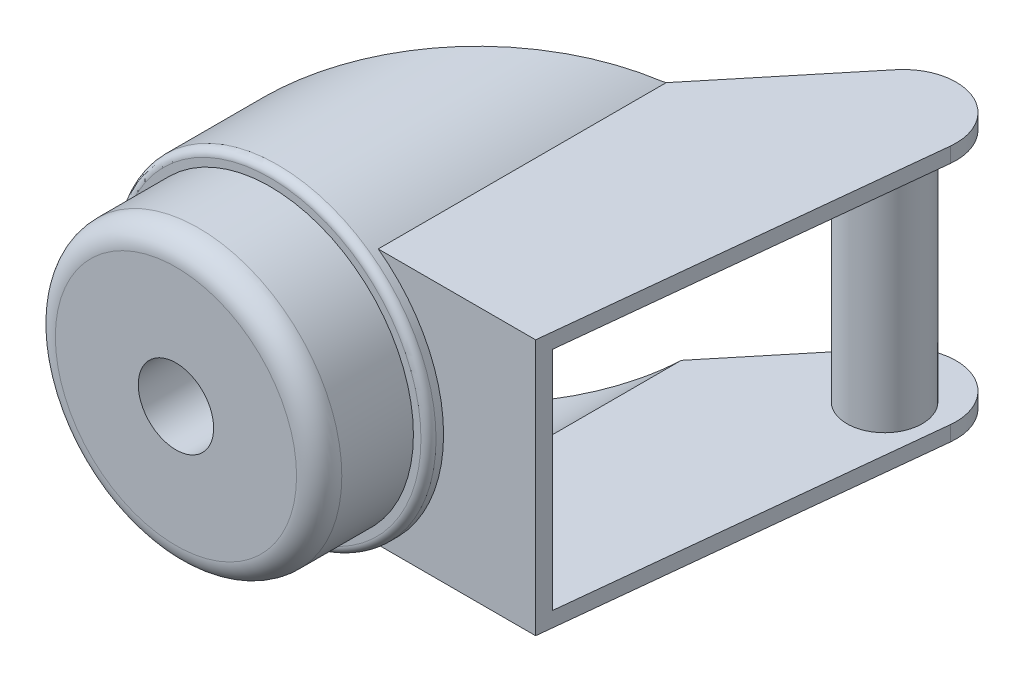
ISO-10303-21;
HEADER;
FILE_DESCRIPTION(('STEP AP214'),'2;1');
FILE_NAME('part.step','',(''),(''),'','','');
FILE_SCHEMA(('AUTOMOTIVE_DESIGN { 1 0 10303 214 1 1 1 1 }'));
ENDSEC;
DATA;
#1=APPLICATION_CONTEXT('core data for automotive mechanical design processes');
#2=APPLICATION_PROTOCOL_DEFINITION('international standard','automotive_design',2000,#1);
#3=PRODUCT_CONTEXT('',#1,'mechanical');
#4=PRODUCT('Part','Part','',(#3));
#5=PRODUCT_RELATED_PRODUCT_CATEGORY('part','',(#4));
#6=PRODUCT_DEFINITION_FORMATION('','',#4);
#7=PRODUCT_DEFINITION_CONTEXT('part definition',#1,'design');
#8=PRODUCT_DEFINITION('design','',#6,#7);
#9=PRODUCT_DEFINITION_SHAPE('','',#8);
#10=(LENGTH_UNIT() NAMED_UNIT(*) SI_UNIT(.MILLI.,.METRE.));
#11=(NAMED_UNIT(*) PLANE_ANGLE_UNIT() SI_UNIT($,.RADIAN.));
#12=(NAMED_UNIT(*) SI_UNIT($,.STERADIAN.) SOLID_ANGLE_UNIT());
#13=UNCERTAINTY_MEASURE_WITH_UNIT(LENGTH_MEASURE(1.E-05),#10,'distance_accuracy_value','');
#14=(GEOMETRIC_REPRESENTATION_CONTEXT(3) GLOBAL_UNCERTAINTY_ASSIGNED_CONTEXT((#13)) GLOBAL_UNIT_ASSIGNED_CONTEXT((#10,
#11,#12)) REPRESENTATION_CONTEXT('',''));
#15=CARTESIAN_POINT('',(0.,0.,0.));
#16=DIRECTION('',(0.,0.,1.));
#17=DIRECTION('',(1.,0.,0.));
#18=AXIS2_PLACEMENT_3D('',#15,#16,#17);
#19=CARTESIAN_POINT('',(0.,0.,-7.75));
#20=DIRECTION('',(0.,0.,1.));
#21=DIRECTION('',(1.,0.,0.));
#22=AXIS2_PLACEMENT_3D('',#19,#20,#21);
#23=CYLINDRICAL_SURFACE('',#22,19.);
#24=CARTESIAN_POINT('',(0.,0.,-12.5));
#25=DIRECTION('',(0.,0.,1.));
#26=DIRECTION('',(1.,0.,0.));
#27=AXIS2_PLACEMENT_3D('',#24,#25,#26);
#28=CIRCLE('',#27,19.);
#29=CARTESIAN_POINT('',(19.,0.,-12.5));
#30=VERTEX_POINT('',#29);
#31=EDGE_CURVE('E19',#30,#30,#28,.F.);
#32=ORIENTED_EDGE('',*,*,#31,.F.);
#33=EDGE_LOOP('',(#32));
#34=FACE_BOUND('',#33,.T.);
#35=CARTESIAN_POINT('',(0.,0.,-3.));
#36=DIRECTION('',(0.,0.,1.));
#37=DIRECTION('',(1.,0.,0.));
#38=AXIS2_PLACEMENT_3D('',#35,#36,#37);
#39=CIRCLE('',#38,19.);
#40=CARTESIAN_POINT('',(19.,0.,-3.));
#41=VERTEX_POINT('',#40);
#42=EDGE_CURVE('E219',#41,#41,#39,.T.);
#43=ORIENTED_EDGE('',*,*,#42,.F.);
#44=EDGE_LOOP('',(#43));
#45=FACE_BOUND('',#44,.T.);
#46=ADVANCED_FACE('F16',(#34,#45),#23,.T.);
#47=CARTESIAN_POINT('',(0.,0.,-3.));
#48=DIRECTION('',(0.,0.,1.));
#49=DIRECTION('',(1.,0.,0.));
#50=AXIS2_PLACEMENT_3D('',#47,#48,#49);
#51=TOROIDAL_SURFACE('',#50,16.,3.);
#52=ORIENTED_EDGE('',*,*,#42,.T.);
#53=EDGE_LOOP('',(#52));
#54=FACE_BOUND('',#53,.T.);
#55=CARTESIAN_POINT('',(0.,0.,0.));
#56=DIRECTION('',(0.,0.,-1.));
#57=DIRECTION('',(1.,0.,0.));
#58=AXIS2_PLACEMENT_3D('',#55,#56,#57);
#59=CIRCLE('',#58,16.);
#60=CARTESIAN_POINT('',(16.,0.,0.));
#61=VERTEX_POINT('',#60);
#62=EDGE_CURVE('E292',#61,#61,#59,.F.);
#63=ORIENTED_EDGE('',*,*,#62,.F.);
#64=EDGE_LOOP('',(#63));
#65=FACE_BOUND('',#64,.T.);
#66=ADVANCED_FACE('F221',(#54,#65),#51,.T.);
#67=CARTESIAN_POINT('',(19.5,0.,-12.5));
#68=DIRECTION('',(0.,0.,1.));
#69=DIRECTION('',(1.,0.,0.));
#70=AXIS2_PLACEMENT_3D('',#67,#68,#69);
#71=PLANE('',#70);
#72=ORIENTED_EDGE('',*,*,#31,.T.);
#73=EDGE_LOOP('',(#72));
#74=FACE_BOUND('',#73,.T.);
#75=CARTESIAN_POINT('',(0.,0.,-12.5));
#76=DIRECTION('',(0.,0.,-1.));
#77=DIRECTION('',(1.,0.,0.));
#78=AXIS2_PLACEMENT_3D('',#75,#76,#77);
#79=CIRCLE('',#78,20.);
#80=CARTESIAN_POINT('',(20.,0.,-12.5));
#81=VERTEX_POINT('',#80);
#82=EDGE_CURVE('E289',#81,#81,#79,.T.);
#83=ORIENTED_EDGE('',*,*,#82,.F.);
#84=EDGE_LOOP('',(#83));
#85=FACE_BOUND('',#84,.T.);
#86=ADVANCED_FACE('F224',(#74,#85),#71,.T.);
#87=CARTESIAN_POINT('',(8.,0.,0.));
#88=DIRECTION('',(0.,0.,1.));
#89=DIRECTION('',(1.,0.,0.));
#90=AXIS2_PLACEMENT_3D('',#87,#88,#89);
#91=PLANE('',#90);
#92=CARTESIAN_POINT('',(0.,0.,0.));
#93=DIRECTION('',(0.,0.,-1.));
#94=DIRECTION('',(-1.,0.,0.));
#95=AXIS2_PLACEMENT_3D('',#92,#93,#94);
#96=CIRCLE('',#95,5.);
#97=CARTESIAN_POINT('',(-5.,0.,0.));
#98=VERTEX_POINT('',#97);
#99=EDGE_CURVE('E183',#98,#98,#96,.T.);
#100=ORIENTED_EDGE('',*,*,#99,.T.);
#101=EDGE_LOOP('',(#100));
#102=FACE_BOUND('',#101,.T.);
#103=ORIENTED_EDGE('',*,*,#62,.T.);
#104=EDGE_LOOP('',(#103));
#105=FACE_BOUND('',#104,.T.);
#106=ADVANCED_FACE('F200',(#102,#105),#91,.T.);
#107=CARTESIAN_POINT('',(0.,0.,-13.5));
#108=DIRECTION('',(0.,0.,1.));
#109=DIRECTION('',(1.,0.,0.));
#110=AXIS2_PLACEMENT_3D('',#107,#108,#109);
#111=TOROIDAL_SURFACE('',#110,20.,1.);
#112=CARTESIAN_POINT('',(0.,0.,-13.5));
#113=DIRECTION('',(0.,0.,-1.));
#114=DIRECTION('',(-1.,0.,0.));
#115=AXIS2_PLACEMENT_3D('',#112,#113,#114);
#116=CIRCLE('',#115,21.);
#117=CARTESIAN_POINT('',(-21.,0.,-13.5));
#118=VERTEX_POINT('',#117);
#119=EDGE_CURVE('E131',#118,#118,#116,.T.);
#120=ORIENTED_EDGE('',*,*,#119,.F.);
#121=EDGE_LOOP('',(#120));
#122=FACE_BOUND('',#121,.T.);
#123=ORIENTED_EDGE('',*,*,#82,.T.);
#124=EDGE_LOOP('',(#123));
#125=FACE_BOUND('',#124,.T.);
#126=ADVANCED_FACE('F194',(#122,#125),#111,.T.);
#127=CARTESIAN_POINT('',(11.7766874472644,0.,-14.5));
#128=DIRECTION('',(0.,0.,1.));
#129=DIRECTION('',(1.,0.,0.));
#130=AXIS2_PLACEMENT_3D('',#127,#128,#129);
#131=PLANE('',#130);
#132=DIRECTION('',(0.,1.,0.));
#133=VECTOR('',#132,1.);
#134=CARTESIAN_POINT('',(33.2110037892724,25.,-14.5));
#135=LINE('',#134,#133);
#136=CARTESIAN_POINT('',(33.2110037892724,-17.,-14.5));
#137=VERTEX_POINT('',#136);
#138=CARTESIAN_POINT('',(33.2110037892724,17.,-14.5));
#139=VERTEX_POINT('',#138);
#140=EDGE_CURVE('E180',#137,#139,#135,.T.);
#141=ORIENTED_EDGE('',*,*,#140,.T.);
#142=DIRECTION('',(1.,0.,0.));
#143=VECTOR('',#142,1.);
#144=CARTESIAN_POINT('',(26.0928177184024,17.,-14.5));
#145=LINE('',#144,#143);
#146=CARTESIAN_POINT('',(12.328828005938,17.,-14.5));
#147=VERTEX_POINT('',#146);
#148=EDGE_CURVE('E158',#147,#139,#145,.T.);
#149=ORIENTED_EDGE('',*,*,#148,.F.);
#150=CARTESIAN_POINT('',(0.,0.,-14.5));
#151=DIRECTION('',(0.,0.,-1.));
#152=DIRECTION('',(-1.,0.,0.));
#153=AXIS2_PLACEMENT_3D('',#150,#151,#152);
#154=CIRCLE('',#153,21.);
#155=CARTESIAN_POINT('',(12.328828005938,-17.,-14.5));
#156=VERTEX_POINT('',#155);
#157=EDGE_CURVE('E130',#156,#147,#154,.F.);
#158=ORIENTED_EDGE('',*,*,#157,.F.);
#159=DIRECTION('',(1.,0.,0.));
#160=VECTOR('',#159,1.);
#161=CARTESIAN_POINT('',(26.0928177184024,-17.,-14.5));
#162=LINE('',#161,#160);
#163=EDGE_CURVE('E139',#137,#156,#162,.F.);
#164=ORIENTED_EDGE('',*,*,#163,.F.);
#165=EDGE_LOOP('',(#141,#149,#158,#164));
#166=FACE_BOUND('',#165,.T.);
#167=ADVANCED_FACE('F199',(#166),#131,.T.);
#168=CARTESIAN_POINT('',(0.,0.,-15.));
#169=DIRECTION('',(0.,0.,-1.));
#170=DIRECTION('',(-1.,0.,0.));
#171=AXIS2_PLACEMENT_3D('',#168,#169,#170);
#172=CYLINDRICAL_SURFACE('',#171,5.);
#173=ORIENTED_EDGE('',*,*,#99,.F.);
#174=EDGE_LOOP('',(#173));
#175=FACE_BOUND('',#174,.T.);
#176=CARTESIAN_POINT('',(0.,0.,-14.5));
#177=DIRECTION('',(0.,0.,-1.));
#178=DIRECTION('',(-1.,0.,0.));
#179=AXIS2_PLACEMENT_3D('',#176,#177,#178);
#180=CIRCLE('',#179,5.);
#181=CARTESIAN_POINT('',(-5.,0.,-14.5));
#182=VERTEX_POINT('',#181);
#183=EDGE_CURVE('E282',#182,#182,#180,.T.);
#184=ORIENTED_EDGE('',*,*,#183,.T.);
#185=EDGE_LOOP('',(#184));
#186=FACE_BOUND('',#185,.T.);
#187=ADVANCED_FACE('F381',(#175,#186),#172,.F.);
#188=CARTESIAN_POINT('',(26.0928177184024,17.,-14.5));
#189=DIRECTION('',(0.,1.,0.));
#190=DIRECTION('',(0.,0.,1.));
#191=AXIS2_PLACEMENT_3D('',#188,#189,#190);
#192=PLANE('',#191);
#193=DIRECTION('',(0.,0.,-1.));
#194=VECTOR('',#193,1.);
#195=CARTESIAN_POINT('',(12.328828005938,17.,-14.5));
#196=LINE('',#195,#194);
#197=CARTESIAN_POINT('',(12.328828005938,17.,-52.7039373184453));
#198=VERTEX_POINT('',#197);
#199=EDGE_CURVE('E169',#147,#198,#196,.T.);
#200=ORIENTED_EDGE('',*,*,#199,.F.);
#201=ORIENTED_EDGE('',*,*,#148,.T.);
#202=DIRECTION('',(-0.104919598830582,0.,0.994480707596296));
#203=VECTOR('',#202,1.);
#204=CARTESIAN_POINT('',(38.4613649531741,17.,-64.2655628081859));
#205=LINE('',#204,#203);
#206=CARTESIAN_POINT('',(38.4613649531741,17.,-64.2655628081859));
#207=VERTEX_POINT('',#206);
#208=EDGE_CURVE('E176',#139,#207,#205,.F.);
#209=ORIENTED_EDGE('',*,*,#208,.T.);
#210=CARTESIAN_POINT('',(31.5,17.,-65.));
#211=DIRECTION('',(0.,-1.,0.));
#212=DIRECTION('',(0.,0.,-1.));
#213=AXIS2_PLACEMENT_3D('',#210,#211,#212);
#214=CIRCLE('',#213,7.00000000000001);
#215=CARTESIAN_POINT('',(26.0928177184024,17.,-69.4454898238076));
#216=VERTEX_POINT('',#215);
#217=EDGE_CURVE('E285',#216,#207,#214,.T.);
#218=ORIENTED_EDGE('',*,*,#217,.F.);
#219=DIRECTION('',(0.635069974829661,0.,-0.772454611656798));
#220=VECTOR('',#219,1.);
#221=CARTESIAN_POINT('',(12.0941428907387,17.,-52.418482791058));
#222=LINE('',#221,#220);
#223=EDGE_CURVE('E171',#216,#198,#222,.F.);
#224=ORIENTED_EDGE('',*,*,#223,.T.);
#225=EDGE_LOOP('',(#200,#201,#209,#218,#224));
#226=FACE_BOUND('',#225,.T.);
#227=ADVANCED_FACE('F379',(#226),#192,.T.);
#228=CARTESIAN_POINT('',(0.,0.,-14.5));
#229=DIRECTION('',(0.,0.,-1.));
#230=DIRECTION('',(-1.,0.,0.));
#231=AXIS2_PLACEMENT_3D('',#228,#229,#230);
#232=CYLINDRICAL_SURFACE('',#231,21.);
#233=DIRECTION('',(0.,0.,-1.));
#234=VECTOR('',#233,1.);
#235=CARTESIAN_POINT('',(-14.696938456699,-15.0000000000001,-16.5));
#236=LINE('',#235,#234);
#237=CARTESIAN_POINT('',(-14.696938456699,-15.0000000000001,-16.5));
#238=VERTEX_POINT('',#237);
#239=CARTESIAN_POINT('',(-14.696938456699,-15.0000000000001,-26.5512318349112));
#240=VERTEX_POINT('',#239);
#241=EDGE_CURVE('E161',#238,#240,#236,.T.);
#242=ORIENTED_EDGE('',*,*,#241,.T.);
#243=CARTESIAN_POINT('',(0.,0.,-40.7413793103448));
#244=DIRECTION('',(0.694594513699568,0.,0.719401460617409));
#245=DIRECTION('',(0.719401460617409,0.,-0.694594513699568));
#246=AXIS2_PLACEMENT_3D('',#243,#244,#245);
#247=ELLIPSE('',#246,29.1909332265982,21.);
#248=CARTESIAN_POINT('',(12.0941428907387,-17.1677519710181,-52.418482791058));
#249=VERTEX_POINT('',#248);
#250=EDGE_CURVE('E128',#240,#249,#247,.T.);
#251=ORIENTED_EDGE('',*,*,#250,.T.);
#252=CARTESIAN_POINT('',(0.,0.,-37.7080149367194));
#253=DIRECTION('',(0.772454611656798,0.,0.635069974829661));
#254=DIRECTION('',(0.635069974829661,0.,-0.772454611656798));
#255=AXIS2_PLACEMENT_3D('',#252,#253,#254);
#256=ELLIPSE('',#255,33.0672222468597,21.);
#257=CARTESIAN_POINT('',(12.328828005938,-17.,-52.7039373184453));
#258=VERTEX_POINT('',#257);
#259=EDGE_CURVE('E119',#249,#258,#256,.T.);
#260=ORIENTED_EDGE('',*,*,#259,.T.);
#261=DIRECTION('',(0.,0.,-1.));
#262=VECTOR('',#261,1.);
#263=CARTESIAN_POINT('',(12.328828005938,-17.,-14.5));
#264=LINE('',#263,#262);
#265=EDGE_CURVE('E126',#156,#258,#264,.T.);
#266=ORIENTED_EDGE('',*,*,#265,.F.);
#267=ORIENTED_EDGE('',*,*,#157,.T.);
#268=ORIENTED_EDGE('',*,*,#199,.T.);
#269=CARTESIAN_POINT('',(0.,0.,-37.7080149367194));
#270=DIRECTION('',(0.772454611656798,0.,0.635069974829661));
#271=DIRECTION('',(0.635069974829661,0.,-0.772454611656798));
#272=AXIS2_PLACEMENT_3D('',#269,#270,#271);
#273=ELLIPSE('',#272,33.0672222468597,21.);
#274=CARTESIAN_POINT('',(12.0941428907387,17.167751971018,-52.418482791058));
#275=VERTEX_POINT('',#274);
#276=EDGE_CURVE('E174',#198,#275,#273,.T.);
#277=ORIENTED_EDGE('',*,*,#276,.T.);
#278=CARTESIAN_POINT('',(0.,0.,-40.7413793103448));
#279=DIRECTION('',(0.694594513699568,0.,0.719401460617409));
#280=DIRECTION('',(0.719401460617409,0.,-0.694594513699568));
#281=AXIS2_PLACEMENT_3D('',#278,#279,#280);
#282=ELLIPSE('',#281,29.1909332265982,21.);
#283=CARTESIAN_POINT('',(-14.696938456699,15.0000000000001,-26.5512318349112));
#284=VERTEX_POINT('',#283);
#285=EDGE_CURVE('E278',#275,#284,#282,.T.);
#286=ORIENTED_EDGE('',*,*,#285,.T.);
#287=DIRECTION('',(0.,0.,-1.));
#288=VECTOR('',#287,1.);
#289=CARTESIAN_POINT('',(-14.696938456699,15.0000000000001,-16.5));
#290=LINE('',#289,#288);
#291=CARTESIAN_POINT('',(-14.696938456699,15.0000000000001,-16.5));
#292=VERTEX_POINT('',#291);
#293=EDGE_CURVE('E165',#284,#292,#290,.F.);
#294=ORIENTED_EDGE('',*,*,#293,.T.);
#295=CARTESIAN_POINT('',(0.,0.,-16.5));
#296=DIRECTION('',(0.,0.,-1.));
#297=DIRECTION('',(-1.,0.,0.));
#298=AXIS2_PLACEMENT_3D('',#295,#296,#297);
#299=CIRCLE('',#298,21.);
#300=EDGE_CURVE('E276',#292,#238,#299,.F.);
#301=ORIENTED_EDGE('',*,*,#300,.T.);
#302=EDGE_LOOP('',(#242,#251,#260,#266,#267,#268,#277,#286,#294,#301));
#303=FACE_BOUND('',#302,.T.);
#304=ORIENTED_EDGE('',*,*,#119,.T.);
#305=EDGE_LOOP('',(#304));
#306=FACE_BOUND('',#305,.T.);
#307=ADVANCED_FACE('F124',(#303,#306),#232,.T.);
#308=CARTESIAN_POINT('',(26.0928177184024,-17.,-14.5));
#309=DIRECTION('',(0.,-1.,0.));
#310=DIRECTION('',(0.,0.,-1.));
#311=AXIS2_PLACEMENT_3D('',#308,#309,#310);
#312=PLANE('',#311);
#313=DIRECTION('',(0.635069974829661,0.,-0.772454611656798));
#314=VECTOR('',#313,1.);
#315=CARTESIAN_POINT('',(12.0941428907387,-17.,-52.418482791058));
#316=LINE('',#315,#314);
#317=CARTESIAN_POINT('',(26.0928177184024,-17.,-69.4454898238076));
#318=VERTEX_POINT('',#317);
#319=EDGE_CURVE('E136',#258,#318,#316,.T.);
#320=ORIENTED_EDGE('',*,*,#319,.T.);
#321=CARTESIAN_POINT('',(31.5,-17.,-65.));
#322=DIRECTION('',(0.,-1.,0.));
#323=DIRECTION('',(0.,0.,-1.));
#324=AXIS2_PLACEMENT_3D('',#321,#322,#323);
#325=CIRCLE('',#324,7.00000000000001);
#326=CARTESIAN_POINT('',(38.4613649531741,-17.,-64.2655628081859));
#327=VERTEX_POINT('',#326);
#328=EDGE_CURVE('E141',#327,#318,#325,.F.);
#329=ORIENTED_EDGE('',*,*,#328,.F.);
#330=DIRECTION('',(-0.104919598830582,0.,0.994480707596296));
#331=VECTOR('',#330,1.);
#332=CARTESIAN_POINT('',(38.4613649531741,-17.,-64.2655628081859));
#333=LINE('',#332,#331);
#334=EDGE_CURVE('E186',#327,#137,#333,.T.);
#335=ORIENTED_EDGE('',*,*,#334,.T.);
#336=ORIENTED_EDGE('',*,*,#163,.T.);
#337=ORIENTED_EDGE('',*,*,#265,.T.);
#338=EDGE_LOOP('',(#320,#329,#335,#336,#337));
#339=FACE_BOUND('',#338,.T.);
#340=ADVANCED_FACE('F135',(#339),#312,.T.);
#341=CARTESIAN_POINT('',(31.5,25.,-65.));
#342=DIRECTION('',(0.,-1.,0.));
#343=DIRECTION('',(0.,0.,-1.));
#344=AXIS2_PLACEMENT_3D('',#341,#342,#343);
#345=CYLINDRICAL_SURFACE('',#344,7.00000000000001);
#346=ORIENTED_EDGE('',*,*,#328,.T.);
#347=DIRECTION('',(0.,1.,0.));
#348=VECTOR('',#347,1.);
#349=CARTESIAN_POINT('',(26.0928177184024,25.,-69.4454898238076));
#350=LINE('',#349,#348);
#351=CARTESIAN_POINT('',(26.0928177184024,-15.,-69.4454898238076));
#352=VERTEX_POINT('',#351);
#353=EDGE_CURVE('E147',#318,#352,#350,.T.);
#354=ORIENTED_EDGE('',*,*,#353,.T.);
#355=CARTESIAN_POINT('',(31.5,-15.,-65.));
#356=DIRECTION('',(0.,-1.,0.));
#357=DIRECTION('',(0.,0.,-1.));
#358=AXIS2_PLACEMENT_3D('',#355,#356,#357);
#359=CIRCLE('',#358,7.00000000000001);
#360=CARTESIAN_POINT('',(38.4613649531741,-15.,-64.2655628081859));
#361=VERTEX_POINT('',#360);
#362=EDGE_CURVE('E273',#361,#352,#359,.F.);
#363=ORIENTED_EDGE('',*,*,#362,.F.);
#364=DIRECTION('',(0.,1.,0.));
#365=VECTOR('',#364,1.);
#366=CARTESIAN_POINT('',(38.4613649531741,25.,-64.2655628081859));
#367=LINE('',#366,#365);
#368=EDGE_CURVE('E154',#361,#327,#367,.F.);
#369=ORIENTED_EDGE('',*,*,#368,.T.);
#370=EDGE_LOOP('',(#346,#354,#363,#369));
#371=FACE_BOUND('',#370,.T.);
#372=ADVANCED_FACE('F370',(#371),#345,.T.);
#373=CARTESIAN_POINT('',(31.5,25.,-65.));
#374=DIRECTION('',(0.,-1.,0.));
#375=DIRECTION('',(0.,0.,-1.));
#376=AXIS2_PLACEMENT_3D('',#373,#374,#375);
#377=CYLINDRICAL_SURFACE('',#376,7.00000000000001);
#378=ORIENTED_EDGE('',*,*,#217,.T.);
#379=DIRECTION('',(0.,1.,0.));
#380=VECTOR('',#379,1.);
#381=CARTESIAN_POINT('',(38.4613649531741,25.,-64.2655628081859));
#382=LINE('',#381,#380);
#383=CARTESIAN_POINT('',(38.4613649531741,15.,-64.2655628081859));
#384=VERTEX_POINT('',#383);
#385=EDGE_CURVE('E179',#207,#384,#382,.F.);
#386=ORIENTED_EDGE('',*,*,#385,.T.);
#387=CARTESIAN_POINT('',(31.5,15.,-65.));
#388=DIRECTION('',(0.,-1.,0.));
#389=DIRECTION('',(0.,0.,-1.));
#390=AXIS2_PLACEMENT_3D('',#387,#388,#389);
#391=CIRCLE('',#390,7.00000000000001);
#392=CARTESIAN_POINT('',(26.0928177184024,15.,-69.4454898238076));
#393=VERTEX_POINT('',#392);
#394=EDGE_CURVE('E264',#393,#384,#391,.T.);
#395=ORIENTED_EDGE('',*,*,#394,.F.);
#396=DIRECTION('',(0.,1.,0.));
#397=VECTOR('',#396,1.);
#398=CARTESIAN_POINT('',(26.0928177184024,25.,-69.4454898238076));
#399=LINE('',#398,#397);
#400=EDGE_CURVE('E175',#393,#216,#399,.T.);
#401=ORIENTED_EDGE('',*,*,#400,.T.);
#402=EDGE_LOOP('',(#378,#386,#395,#401));
#403=FACE_BOUND('',#402,.T.);
#404=ADVANCED_FACE('F366',(#403),#377,.T.);
#405=CARTESIAN_POINT('',(38.4613649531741,25.,-64.2655628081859));
#406=DIRECTION('',(-0.994480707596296,0.,-0.104919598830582));
#407=DIRECTION('',(-0.104919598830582,0.,0.994480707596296));
#408=AXIS2_PLACEMENT_3D('',#405,#406,#407);
#409=PLANE('',#408);
#410=ORIENTED_EDGE('',*,*,#385,.F.);
#411=ORIENTED_EDGE('',*,*,#208,.F.);
#412=ORIENTED_EDGE('',*,*,#140,.F.);
#413=ORIENTED_EDGE('',*,*,#334,.F.);
#414=ORIENTED_EDGE('',*,*,#368,.F.);
#415=DIRECTION('',(0.104919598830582,0.,-0.994480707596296));
#416=VECTOR('',#415,1.);
#417=CARTESIAN_POINT('',(33.4220075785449,-15.,-16.5));
#418=LINE('',#417,#416);
#419=CARTESIAN_POINT('',(33.4220075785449,-15.,-16.5));
#420=VERTEX_POINT('',#419);
#421=EDGE_CURVE('E150',#420,#361,#418,.T.);
#422=ORIENTED_EDGE('',*,*,#421,.F.);
#423=DIRECTION('',(0.,1.,0.));
#424=VECTOR('',#423,1.);
#425=CARTESIAN_POINT('',(33.4220075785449,0.,-16.5));
#426=LINE('',#425,#424);
#427=CARTESIAN_POINT('',(33.4220075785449,15.,-16.5));
#428=VERTEX_POINT('',#427);
#429=EDGE_CURVE('E425',#420,#428,#426,.T.);
#430=ORIENTED_EDGE('',*,*,#429,.T.);
#431=DIRECTION('',(-0.104919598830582,0.,0.994480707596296));
#432=VECTOR('',#431,1.);
#433=CARTESIAN_POINT('',(38.4613649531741,15.,-64.2655628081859));
#434=LINE('',#433,#432);
#435=EDGE_CURVE('E266',#384,#428,#434,.T.);
#436=ORIENTED_EDGE('',*,*,#435,.F.);
#437=EDGE_LOOP('',(#410,#411,#412,#413,#414,#422,#430,#436));
#438=FACE_BOUND('',#437,.T.);
#439=ADVANCED_FACE('F362',(#438),#409,.F.);
#440=CARTESIAN_POINT('',(31.5,15.,-62.5));
#441=DIRECTION('',(0.,-1.,0.));
#442=DIRECTION('',(0.,0.,-1.));
#443=AXIS2_PLACEMENT_3D('',#440,#441,#442);
#444=CYLINDRICAL_SURFACE('',#443,5.);
#445=CARTESIAN_POINT('',(31.5,15.,-62.5));
#446=DIRECTION('',(0.,-1.,0.));
#447=DIRECTION('',(0.,0.,-1.));
#448=AXIS2_PLACEMENT_3D('',#445,#446,#447);
#449=CIRCLE('',#448,5.);
#450=CARTESIAN_POINT('',(31.5,15.,-67.5));
#451=VERTEX_POINT('',#450);
#452=EDGE_CURVE('E261',#451,#451,#449,.F.);
#453=ORIENTED_EDGE('',*,*,#452,.F.);
#454=EDGE_LOOP('',(#453));
#455=FACE_BOUND('',#454,.T.);
#456=CARTESIAN_POINT('',(31.5,-15.,-62.5));
#457=DIRECTION('',(0.,-1.,0.));
#458=DIRECTION('',(0.,0.,-1.));
#459=AXIS2_PLACEMENT_3D('',#456,#457,#458);
#460=CIRCLE('',#459,5.);
#461=CARTESIAN_POINT('',(31.5,-15.,-67.5));
#462=VERTEX_POINT('',#461);
#463=EDGE_CURVE('E268',#462,#462,#460,.T.);
#464=ORIENTED_EDGE('',*,*,#463,.F.);
#465=EDGE_LOOP('',(#464));
#466=FACE_BOUND('',#465,.T.);
#467=ADVANCED_FACE('F358',(#455,#466),#444,.T.);
#468=CARTESIAN_POINT('',(0.,0.,-14.5));
#469=DIRECTION('',(0.,0.,1.));
#470=DIRECTION('',(1.,0.,0.));
#471=AXIS2_PLACEMENT_3D('',#468,#469,#470);
#472=PLANE('',#471);
#473=ORIENTED_EDGE('',*,*,#183,.F.);
#474=EDGE_LOOP('',(#473));
#475=FACE_BOUND('',#474,.T.);
#476=CARTESIAN_POINT('',(0.,0.,-14.5));
#477=DIRECTION('',(0.,0.,-1.));
#478=DIRECTION('',(-1.,0.,0.));
#479=AXIS2_PLACEMENT_3D('',#476,#477,#478);
#480=CIRCLE('',#479,20.);
#481=CARTESIAN_POINT('',(-20.,0.,-14.5));
#482=VERTEX_POINT('',#481);
#483=EDGE_CURVE('E258',#482,#482,#480,.T.);
#484=ORIENTED_EDGE('',*,*,#483,.T.);
#485=EDGE_LOOP('',(#484));
#486=FACE_BOUND('',#485,.T.);
#487=ADVANCED_FACE('F354',(#475,#486),#472,.F.);
#488=CARTESIAN_POINT('',(12.0941428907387,25.,-52.418482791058));
#489=DIRECTION('',(0.772454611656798,0.,0.635069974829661));
#490=DIRECTION('',(0.635069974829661,0.,-0.772454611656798));
#491=AXIS2_PLACEMENT_3D('',#488,#489,#490);
#492=PLANE('',#491);
#493=CARTESIAN_POINT('',(0.,0.,-37.7080149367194));
#494=DIRECTION('',(0.772454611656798,0.,0.635069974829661));
#495=DIRECTION('',(0.635069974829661,0.,-0.772454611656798));
#496=AXIS2_PLACEMENT_3D('',#493,#494,#495);
#497=ELLIPSE('',#496,31.4925926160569,20.);
#498=CARTESIAN_POINT('',(13.228756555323,15.,-53.7985473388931));
#499=VERTEX_POINT('',#498);
#500=CARTESIAN_POINT('',(12.0941428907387,15.9289581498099,-52.418482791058));
#501=VERTEX_POINT('',#500);
#502=EDGE_CURVE('E255',#499,#501,#497,.T.);
#503=ORIENTED_EDGE('',*,*,#502,.T.);
#504=DIRECTION('',(0.,1.,0.));
#505=VECTOR('',#504,1.);
#506=CARTESIAN_POINT('',(12.0941428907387,25.,-52.418482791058));
#507=LINE('',#506,#505);
#508=EDGE_CURVE('E280',#501,#275,#507,.T.);
#509=ORIENTED_EDGE('',*,*,#508,.T.);
#510=ORIENTED_EDGE('',*,*,#276,.F.);
#511=ORIENTED_EDGE('',*,*,#223,.F.);
#512=ORIENTED_EDGE('',*,*,#400,.F.);
#513=DIRECTION('',(0.635069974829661,0.,-0.772454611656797));
#514=VECTOR('',#513,1.);
#515=CARTESIAN_POINT('',(13.228756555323,15.,-53.7985473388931));
#516=LINE('',#515,#514);
#517=EDGE_CURVE('E267',#499,#393,#516,.T.);
#518=ORIENTED_EDGE('',*,*,#517,.F.);
#519=EDGE_LOOP('',(#503,#509,#510,#511,#512,#518));
#520=FACE_BOUND('',#519,.T.);
#521=ADVANCED_FACE('F350',(#520),#492,.F.);
#522=CARTESIAN_POINT('',(-14.696938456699,25.,-26.5512318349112));
#523=DIRECTION('',(0.694594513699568,0.,0.719401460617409));
#524=DIRECTION('',(0.719401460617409,0.,-0.694594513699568));
#525=AXIS2_PLACEMENT_3D('',#522,#523,#524);
#526=PLANE('',#525);
#527=DIRECTION('',(0.,1.,0.));
#528=VECTOR('',#527,1.);
#529=CARTESIAN_POINT('',(-14.696938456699,25.,-26.5512318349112));
#530=LINE('',#529,#528);
#531=CARTESIAN_POINT('',(-14.696938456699,13.5646599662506,-26.5512318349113));
#532=VERTEX_POINT('',#531);
#533=EDGE_CURVE('E168',#532,#284,#530,.T.);
#534=ORIENTED_EDGE('',*,*,#533,.T.);
#535=ORIENTED_EDGE('',*,*,#285,.F.);
#536=ORIENTED_EDGE('',*,*,#508,.F.);
#537=CARTESIAN_POINT('',(0.,0.,-40.7413793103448));
#538=DIRECTION('',(0.694594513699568,0.,0.719401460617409));
#539=DIRECTION('',(0.719401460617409,0.,-0.694594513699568));
#540=AXIS2_PLACEMENT_3D('',#537,#538,#539);
#541=ELLIPSE('',#540,27.8008887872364,20.);
#542=EDGE_CURVE('E252',#501,#532,#541,.T.);
#543=ORIENTED_EDGE('',*,*,#542,.T.);
#544=EDGE_LOOP('',(#534,#535,#536,#543));
#545=FACE_BOUND('',#544,.T.);
#546=ADVANCED_FACE('F346',(#545),#526,.F.);
#547=CARTESIAN_POINT('',(-14.696938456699,25.,-16.5));
#548=DIRECTION('',(1.,0.,0.));
#549=DIRECTION('',(0.,0.,-1.));
#550=AXIS2_PLACEMENT_3D('',#547,#548,#549);
#551=PLANE('',#550);
#552=DIRECTION('',(0.,1.,0.));
#553=VECTOR('',#552,1.);
#554=CARTESIAN_POINT('',(-14.696938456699,25.,-16.5));
#555=LINE('',#554,#553);
#556=CARTESIAN_POINT('',(-14.696938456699,13.5646599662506,-16.5));
#557=VERTEX_POINT('',#556);
#558=EDGE_CURVE('E167',#557,#292,#555,.T.);
#559=ORIENTED_EDGE('',*,*,#558,.T.);
#560=ORIENTED_EDGE('',*,*,#293,.F.);
#561=ORIENTED_EDGE('',*,*,#533,.F.);
#562=DIRECTION('',(0.,0.,-1.));
#563=VECTOR('',#562,1.);
#564=CARTESIAN_POINT('',(-14.696938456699,13.5646599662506,-44.5));
#565=LINE('',#564,#563);
#566=EDGE_CURVE('E251',#532,#557,#565,.F.);
#567=ORIENTED_EDGE('',*,*,#566,.T.);
#568=EDGE_LOOP('',(#559,#560,#561,#567));
#569=FACE_BOUND('',#568,.T.);
#570=ADVANCED_FACE('F342',(#569),#551,.F.);
#571=CARTESIAN_POINT('',(-20.,25.,-16.5));
#572=DIRECTION('',(0.,0.,1.));
#573=DIRECTION('',(1.,0.,0.));
#574=AXIS2_PLACEMENT_3D('',#571,#572,#573);
#575=PLANE('',#574);
#576=DIRECTION('',(0.,1.,0.));
#577=VECTOR('',#576,1.);
#578=CARTESIAN_POINT('',(-14.696938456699,25.,-16.5));
#579=LINE('',#578,#577);
#580=CARTESIAN_POINT('',(-14.696938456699,-13.5646599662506,-16.5));
#581=VERTEX_POINT('',#580);
#582=EDGE_CURVE('E164',#581,#238,#579,.F.);
#583=ORIENTED_EDGE('',*,*,#582,.T.);
#584=ORIENTED_EDGE('',*,*,#300,.F.);
#585=ORIENTED_EDGE('',*,*,#558,.F.);
#586=CARTESIAN_POINT('',(0.,0.,-16.5));
#587=DIRECTION('',(0.,0.,-1.));
#588=DIRECTION('',(-1.,0.,0.));
#589=AXIS2_PLACEMENT_3D('',#586,#587,#588);
#590=CIRCLE('',#589,20.);
#591=EDGE_CURVE('E248',#557,#581,#590,.F.);
#592=ORIENTED_EDGE('',*,*,#591,.T.);
#593=EDGE_LOOP('',(#583,#584,#585,#592));
#594=FACE_BOUND('',#593,.T.);
#595=ADVANCED_FACE('F338',(#594),#575,.F.);
#596=CARTESIAN_POINT('',(-14.696938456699,25.,-16.5));
#597=DIRECTION('',(1.,0.,0.));
#598=DIRECTION('',(0.,0.,-1.));
#599=AXIS2_PLACEMENT_3D('',#596,#597,#598);
#600=PLANE('',#599);
#601=DIRECTION('',(0.,1.,0.));
#602=VECTOR('',#601,1.);
#603=CARTESIAN_POINT('',(-14.696938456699,25.,-26.5512318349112));
#604=LINE('',#603,#602);
#605=CARTESIAN_POINT('',(-14.696938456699,-13.5646599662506,-26.5512318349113));
#606=VERTEX_POINT('',#605);
#607=EDGE_CURVE('E163',#606,#240,#604,.F.);
#608=ORIENTED_EDGE('',*,*,#607,.T.);
#609=ORIENTED_EDGE('',*,*,#241,.F.);
#610=ORIENTED_EDGE('',*,*,#582,.F.);
#611=DIRECTION('',(0.,0.,-1.));
#612=VECTOR('',#611,1.);
#613=CARTESIAN_POINT('',(-14.696938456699,-13.5646599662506,-44.5));
#614=LINE('',#613,#612);
#615=EDGE_CURVE('E247',#581,#606,#614,.T.);
#616=ORIENTED_EDGE('',*,*,#615,.T.);
#617=EDGE_LOOP('',(#608,#609,#610,#616));
#618=FACE_BOUND('',#617,.T.);
#619=ADVANCED_FACE('F334',(#618),#600,.F.);
#620=CARTESIAN_POINT('',(-14.696938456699,25.,-26.5512318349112));
#621=DIRECTION('',(0.694594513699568,0.,0.719401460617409));
#622=DIRECTION('',(0.719401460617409,0.,-0.694594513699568));
#623=AXIS2_PLACEMENT_3D('',#620,#621,#622);
#624=PLANE('',#623);
#625=DIRECTION('',(0.,1.,0.));
#626=VECTOR('',#625,1.);
#627=CARTESIAN_POINT('',(12.0941428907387,25.,-52.418482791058));
#628=LINE('',#627,#626);
#629=CARTESIAN_POINT('',(12.0941428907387,-15.9289581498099,-52.418482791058));
#630=VERTEX_POINT('',#629);
#631=EDGE_CURVE('E148',#630,#249,#628,.F.);
#632=ORIENTED_EDGE('',*,*,#631,.T.);
#633=ORIENTED_EDGE('',*,*,#250,.F.);
#634=ORIENTED_EDGE('',*,*,#607,.F.);
#635=CARTESIAN_POINT('',(0.,0.,-40.7413793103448));
#636=DIRECTION('',(0.694594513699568,0.,0.719401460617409));
#637=DIRECTION('',(0.719401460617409,0.,-0.694594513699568));
#638=AXIS2_PLACEMENT_3D('',#635,#636,#637);
#639=ELLIPSE('',#638,27.8008887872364,20.);
#640=EDGE_CURVE('E244',#606,#630,#639,.T.);
#641=ORIENTED_EDGE('',*,*,#640,.T.);
#642=EDGE_LOOP('',(#632,#633,#634,#641));
#643=FACE_BOUND('',#642,.T.);
#644=ADVANCED_FACE('F331',(#643),#624,.F.);
#645=CARTESIAN_POINT('',(12.0941428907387,25.,-52.418482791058));
#646=DIRECTION('',(0.772454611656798,0.,0.635069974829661));
#647=DIRECTION('',(0.635069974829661,0.,-0.772454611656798));
#648=AXIS2_PLACEMENT_3D('',#645,#646,#647);
#649=PLANE('',#648);
#650=ORIENTED_EDGE('',*,*,#353,.F.);
#651=ORIENTED_EDGE('',*,*,#319,.F.);
#652=ORIENTED_EDGE('',*,*,#259,.F.);
#653=ORIENTED_EDGE('',*,*,#631,.F.);
#654=CARTESIAN_POINT('',(0.,0.,-37.7080149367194));
#655=DIRECTION('',(0.772454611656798,0.,0.635069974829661));
#656=DIRECTION('',(0.635069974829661,0.,-0.772454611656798));
#657=AXIS2_PLACEMENT_3D('',#654,#655,#656);
#658=ELLIPSE('',#657,31.4925926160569,20.);
#659=CARTESIAN_POINT('',(13.228756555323,-15.,-53.7985473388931));
#660=VERTEX_POINT('',#659);
#661=EDGE_CURVE('E241',#630,#660,#658,.T.);
#662=ORIENTED_EDGE('',*,*,#661,.T.);
#663=DIRECTION('',(-0.635069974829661,0.,0.772454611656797));
#664=VECTOR('',#663,1.);
#665=CARTESIAN_POINT('',(26.0928177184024,-15.,-69.4454898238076));
#666=LINE('',#665,#664);
#667=EDGE_CURVE('E272',#352,#660,#666,.T.);
#668=ORIENTED_EDGE('',*,*,#667,.F.);
#669=EDGE_LOOP('',(#650,#651,#652,#653,#662,#668));
#670=FACE_BOUND('',#669,.T.);
#671=ADVANCED_FACE('F144',(#670),#649,.F.);
#672=CARTESIAN_POINT('',(25.,-15.,-46.5));
#673=DIRECTION('',(0.,1.,0.));
#674=DIRECTION('',(0.,0.,1.));
#675=AXIS2_PLACEMENT_3D('',#672,#673,#674);
#676=PLANE('',#675);
#677=ORIENTED_EDGE('',*,*,#463,.T.);
#678=EDGE_LOOP('',(#677));
#679=FACE_BOUND('',#678,.T.);
#680=ORIENTED_EDGE('',*,*,#362,.T.);
#681=ORIENTED_EDGE('',*,*,#667,.T.);
#682=DIRECTION('',(0.,0.,-1.));
#683=VECTOR('',#682,1.);
#684=CARTESIAN_POINT('',(13.228756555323,-15.,-44.5));
#685=LINE('',#684,#683);
#686=CARTESIAN_POINT('',(13.228756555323,-15.,-16.5));
#687=VERTEX_POINT('',#686);
#688=EDGE_CURVE('E240',#660,#687,#685,.F.);
#689=ORIENTED_EDGE('',*,*,#688,.T.);
#690=DIRECTION('',(1.,0.,0.));
#691=VECTOR('',#690,1.);
#692=CARTESIAN_POINT('',(25.,-15.,-16.5));
#693=LINE('',#692,#691);
#694=EDGE_CURVE('E271',#687,#420,#693,.T.);
#695=ORIENTED_EDGE('',*,*,#694,.T.);
#696=ORIENTED_EDGE('',*,*,#421,.T.);
#697=EDGE_LOOP('',(#680,#681,#689,#695,#696));
#698=FACE_BOUND('',#697,.T.);
#699=ADVANCED_FACE('F324',(#679,#698),#676,.T.);
#700=CARTESIAN_POINT('',(25.,0.,-16.5));
#701=DIRECTION('',(0.,0.,1.));
#702=DIRECTION('',(1.,0.,0.));
#703=AXIS2_PLACEMENT_3D('',#700,#701,#702);
#704=PLANE('',#703);
#705=DIRECTION('',(1.,0.,0.));
#706=VECTOR('',#705,1.);
#707=CARTESIAN_POINT('',(25.,15.,-16.5));
#708=LINE('',#707,#706);
#709=CARTESIAN_POINT('',(13.228756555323,15.,-16.5));
#710=VERTEX_POINT('',#709);
#711=EDGE_CURVE('E33',#428,#710,#708,.F.);
#712=ORIENTED_EDGE('',*,*,#711,.F.);
#713=ORIENTED_EDGE('',*,*,#429,.F.);
#714=ORIENTED_EDGE('',*,*,#694,.F.);
#715=CARTESIAN_POINT('',(0.,0.,-16.5));
#716=DIRECTION('',(0.,0.,-1.));
#717=DIRECTION('',(-1.,0.,0.));
#718=AXIS2_PLACEMENT_3D('',#715,#716,#717);
#719=CIRCLE('',#718,20.);
#720=EDGE_CURVE('E25',#687,#710,#719,.F.);
#721=ORIENTED_EDGE('',*,*,#720,.T.);
#722=EDGE_LOOP('',(#712,#713,#714,#721));
#723=FACE_BOUND('',#722,.T.);
#724=ADVANCED_FACE('F316',(#723),#704,.F.);
#725=CARTESIAN_POINT('',(25.,15.,-46.5));
#726=DIRECTION('',(0.,-1.,0.));
#727=DIRECTION('',(0.,0.,-1.));
#728=AXIS2_PLACEMENT_3D('',#725,#726,#727);
#729=PLANE('',#728);
#730=ORIENTED_EDGE('',*,*,#452,.T.);
#731=EDGE_LOOP('',(#730));
#732=FACE_BOUND('',#731,.T.);
#733=ORIENTED_EDGE('',*,*,#435,.T.);
#734=ORIENTED_EDGE('',*,*,#711,.T.);
#735=DIRECTION('',(0.,0.,-1.));
#736=VECTOR('',#735,1.);
#737=CARTESIAN_POINT('',(13.228756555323,15.,-44.5));
#738=LINE('',#737,#736);
#739=EDGE_CURVE('E11',#710,#499,#738,.T.);
#740=ORIENTED_EDGE('',*,*,#739,.T.);
#741=ORIENTED_EDGE('',*,*,#517,.T.);
#742=ORIENTED_EDGE('',*,*,#394,.T.);
#743=EDGE_LOOP('',(#733,#734,#740,#741,#742));
#744=FACE_BOUND('',#743,.T.);
#745=ADVANCED_FACE('F310',(#732,#744),#729,.T.);
#746=CARTESIAN_POINT('',(0.,0.,-44.5));
#747=DIRECTION('',(0.,0.,-1.));
#748=DIRECTION('',(-1.,0.,0.));
#749=AXIS2_PLACEMENT_3D('',#746,#747,#748);
#750=CYLINDRICAL_SURFACE('',#749,20.);
#751=ORIENTED_EDGE('',*,*,#720,.F.);
#752=ORIENTED_EDGE('',*,*,#688,.F.);
#753=ORIENTED_EDGE('',*,*,#661,.F.);
#754=ORIENTED_EDGE('',*,*,#640,.F.);
#755=ORIENTED_EDGE('',*,*,#615,.F.);
#756=ORIENTED_EDGE('',*,*,#591,.F.);
#757=ORIENTED_EDGE('',*,*,#566,.F.);
#758=ORIENTED_EDGE('',*,*,#542,.F.);
#759=ORIENTED_EDGE('',*,*,#502,.F.);
#760=ORIENTED_EDGE('',*,*,#739,.F.);
#761=EDGE_LOOP('',(#751,#752,#753,#754,#755,#756,#757,#758,#759,#760));
#762=FACE_BOUND('',#761,.T.);
#763=ORIENTED_EDGE('',*,*,#483,.F.);
#764=EDGE_LOOP('',(#763));
#765=FACE_BOUND('',#764,.T.);
#766=ADVANCED_FACE('F308',(#762,#765),#750,.F.);
#767=CLOSED_SHELL('',(#46,#66,#86,#106,#126,#167,#187,#227,#307,#340,#372,#404,#439,#467,#487,
#521,#546,#570,#595,#619,#644,#671,#699,#724,#745,#766));
#768=MANIFOLD_SOLID_BREP('B1',#767);
#769=ADVANCED_BREP_SHAPE_REPRESENTATION('',(#18,#768),#14);
#770=SHAPE_DEFINITION_REPRESENTATION(#9,#769);
ENDSEC;
END-ISO-10303-21;
